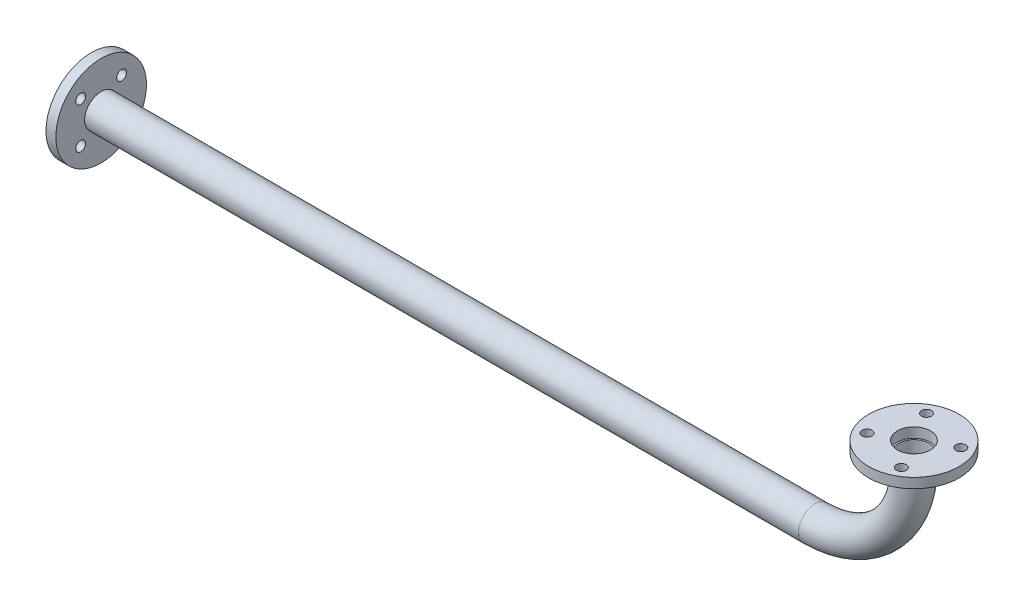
ISO-10303-21;
HEADER;
FILE_DESCRIPTION(('STEP AP214'),'2;1');
FILE_NAME('part.step','',(''),(''),'','','');
FILE_SCHEMA(('AUTOMOTIVE_DESIGN { 1 0 10303 214 1 1 1 1 }'));
ENDSEC;
DATA;
#1=APPLICATION_CONTEXT('core data for automotive mechanical design processes');
#2=APPLICATION_PROTOCOL_DEFINITION('international standard','automotive_design',2000,#1);
#3=PRODUCT_CONTEXT('',#1,'mechanical');
#4=PRODUCT('Part','Part','',(#3));
#5=PRODUCT_RELATED_PRODUCT_CATEGORY('part','',(#4));
#6=PRODUCT_DEFINITION_FORMATION('','',#4);
#7=PRODUCT_DEFINITION_CONTEXT('part definition',#1,'design');
#8=PRODUCT_DEFINITION('design','',#6,#7);
#9=PRODUCT_DEFINITION_SHAPE('','',#8);
#10=(LENGTH_UNIT() NAMED_UNIT(*) SI_UNIT(.MILLI.,.METRE.));
#11=(NAMED_UNIT(*) PLANE_ANGLE_UNIT() SI_UNIT($,.RADIAN.));
#12=(NAMED_UNIT(*) SI_UNIT($,.STERADIAN.) SOLID_ANGLE_UNIT());
#13=UNCERTAINTY_MEASURE_WITH_UNIT(LENGTH_MEASURE(1.E-05),#10,'distance_accuracy_value','');
#14=(GEOMETRIC_REPRESENTATION_CONTEXT(3) GLOBAL_UNCERTAINTY_ASSIGNED_CONTEXT((#13)) GLOBAL_UNIT_ASSIGNED_CONTEXT((#10,
#11,#12)) REPRESENTATION_CONTEXT('',''));
#15=CARTESIAN_POINT('',(0.,0.,0.));
#16=DIRECTION('',(0.,0.,1.));
#17=DIRECTION('',(1.,0.,0.));
#18=AXIS2_PLACEMENT_3D('',#15,#16,#17);
#19=CARTESIAN_POINT('',(0.,18.,0.));
#20=DIRECTION('',(0.,1.,0.));
#21=DIRECTION('',(0.,0.,1.));
#22=AXIS2_PLACEMENT_3D('',#19,#20,#21);
#23=PLANE('',#22);
#24=CARTESIAN_POINT('',(54.1265877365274,18.,-31.2500000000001));
#25=DIRECTION('',(0.,1.,0.));
#26=DIRECTION('',(0.,0.,-1.));
#27=AXIS2_PLACEMENT_3D('',#24,#25,#26);
#28=CIRCLE('',#27,9.00000000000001);
#29=CARTESIAN_POINT('',(54.1265877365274,18.,-40.2500000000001));
#30=VERTEX_POINT('',#29);
#31=EDGE_CURVE('E94',#30,#30,#28,.T.);
#32=ORIENTED_EDGE('',*,*,#31,.F.);
#33=EDGE_LOOP('',(#32));
#34=FACE_BOUND('',#33,.T.);
#35=CARTESIAN_POINT('',(-31.2500000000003,18.,-54.1265877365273));
#36=DIRECTION('',(0.,1.,0.));
#37=DIRECTION('',(0.,0.,1.));
#38=AXIS2_PLACEMENT_3D('',#35,#36,#37);
#39=CIRCLE('',#38,9.00000000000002);
#40=CARTESIAN_POINT('',(-31.2500000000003,18.,-45.1265877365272));
#41=VERTEX_POINT('',#40);
#42=EDGE_CURVE('E78',#41,#41,#39,.T.);
#43=ORIENTED_EDGE('',*,*,#42,.F.);
#44=EDGE_LOOP('',(#43));
#45=FACE_BOUND('',#44,.T.);
#46=CARTESIAN_POINT('',(0.,18.,0.));
#47=DIRECTION('',(0.,1.,0.));
#48=DIRECTION('',(0.,0.,1.));
#49=AXIS2_PLACEMENT_3D('',#46,#47,#48);
#50=CIRCLE('',#49,82.5);
#51=CARTESIAN_POINT('',(0.,18.,82.5));
#52=VERTEX_POINT('',#51);
#53=EDGE_CURVE('E12',#52,#52,#50,.T.);
#54=ORIENTED_EDGE('',*,*,#53,.T.);
#55=EDGE_LOOP('',(#54));
#56=FACE_BOUND('',#55,.T.);
#57=CARTESIAN_POINT('',(0.,18.,0.));
#58=DIRECTION('',(0.,1.,0.));
#59=DIRECTION('',(0.,0.,1.));
#60=AXIS2_PLACEMENT_3D('',#57,#58,#59);
#61=CIRCLE('',#60,30.15);
#62=CARTESIAN_POINT('',(0.,18.,30.15));
#63=VERTEX_POINT('',#62);
#64=EDGE_CURVE('E72',#63,#63,#61,.T.);
#65=ORIENTED_EDGE('',*,*,#64,.F.);
#66=EDGE_LOOP('',(#65));
#67=FACE_BOUND('',#66,.T.);
#68=CARTESIAN_POINT('',(-54.1265877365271,18.,31.2500000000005));
#69=DIRECTION('',(0.,1.,0.));
#70=DIRECTION('',(0.,0.,1.));
#71=AXIS2_PLACEMENT_3D('',#68,#69,#70);
#72=CIRCLE('',#71,9.);
#73=CARTESIAN_POINT('',(-54.1265877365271,18.,40.2500000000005));
#74=VERTEX_POINT('',#73);
#75=EDGE_CURVE('E86',#74,#74,#72,.T.);
#76=ORIENTED_EDGE('',*,*,#75,.F.);
#77=EDGE_LOOP('',(#76));
#78=FACE_BOUND('',#77,.T.);
#79=CARTESIAN_POINT('',(31.2500000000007,18.,54.126587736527));
#80=DIRECTION('',(0.,1.,0.));
#81=DIRECTION('',(0.,0.,-1.));
#82=AXIS2_PLACEMENT_3D('',#79,#80,#81);
#83=CIRCLE('',#82,9.00000000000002);
#84=CARTESIAN_POINT('',(31.2500000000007,18.,45.126587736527));
#85=VERTEX_POINT('',#84);
#86=EDGE_CURVE('E102',#85,#85,#83,.T.);
#87=ORIENTED_EDGE('',*,*,#86,.F.);
#88=EDGE_LOOP('',(#87));
#89=FACE_BOUND('',#88,.T.);
#90=ADVANCED_FACE('F58',(#34,#45,#56,#67,#78,#89),#23,.T.);
#91=CARTESIAN_POINT('',(0.,0.,0.));
#92=DIRECTION('',(0.,1.,0.));
#93=DIRECTION('',(0.,0.,1.));
#94=AXIS2_PLACEMENT_3D('',#91,#92,#93);
#95=PLANE('',#94);
#96=CARTESIAN_POINT('',(0.,0.,0.));
#97=DIRECTION('',(0.,1.,0.));
#98=DIRECTION('',(0.,0.,1.));
#99=AXIS2_PLACEMENT_3D('',#96,#97,#98);
#100=CIRCLE('',#99,82.5);
#101=CARTESIAN_POINT('',(0.,0.,82.5));
#102=VERTEX_POINT('',#101);
#103=EDGE_CURVE('E62',#102,#102,#100,.T.);
#104=ORIENTED_EDGE('',*,*,#103,.F.);
#105=EDGE_LOOP('',(#104));
#106=FACE_BOUND('',#105,.T.);
#107=CARTESIAN_POINT('',(0.,0.,0.));
#108=DIRECTION('',(0.,1.,0.));
#109=DIRECTION('',(0.,0.,1.));
#110=AXIS2_PLACEMENT_3D('',#107,#108,#109);
#111=CIRCLE('',#110,30.15);
#112=CARTESIAN_POINT('',(0.,0.,30.15));
#113=VERTEX_POINT('',#112);
#114=EDGE_CURVE('E74',#113,#113,#111,.T.);
#115=ORIENTED_EDGE('',*,*,#114,.T.);
#116=EDGE_LOOP('',(#115));
#117=FACE_BOUND('',#116,.T.);
#118=CARTESIAN_POINT('',(-31.2500000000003,0.,-54.1265877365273));
#119=DIRECTION('',(0.,1.,0.));
#120=DIRECTION('',(0.,0.,1.));
#121=AXIS2_PLACEMENT_3D('',#118,#119,#120);
#122=CIRCLE('',#121,9.00000000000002);
#123=CARTESIAN_POINT('',(-31.2500000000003,0.,-45.1265877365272));
#124=VERTEX_POINT('',#123);
#125=EDGE_CURVE('E82',#124,#124,#122,.T.);
#126=ORIENTED_EDGE('',*,*,#125,.T.);
#127=EDGE_LOOP('',(#126));
#128=FACE_BOUND('',#127,.T.);
#129=CARTESIAN_POINT('',(-54.1265877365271,0.,31.2500000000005));
#130=DIRECTION('',(0.,1.,0.));
#131=DIRECTION('',(0.,0.,1.));
#132=AXIS2_PLACEMENT_3D('',#129,#130,#131);
#133=CIRCLE('',#132,9.);
#134=CARTESIAN_POINT('',(-54.1265877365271,0.,40.2500000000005));
#135=VERTEX_POINT('',#134);
#136=EDGE_CURVE('E90',#135,#135,#133,.T.);
#137=ORIENTED_EDGE('',*,*,#136,.T.);
#138=EDGE_LOOP('',(#137));
#139=FACE_BOUND('',#138,.T.);
#140=CARTESIAN_POINT('',(54.1265877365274,0.,-31.2500000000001));
#141=DIRECTION('',(0.,1.,0.));
#142=DIRECTION('',(0.,0.,-1.));
#143=AXIS2_PLACEMENT_3D('',#140,#141,#142);
#144=CIRCLE('',#143,9.00000000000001);
#145=CARTESIAN_POINT('',(54.1265877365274,0.,-40.2500000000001));
#146=VERTEX_POINT('',#145);
#147=EDGE_CURVE('E98',#146,#146,#144,.T.);
#148=ORIENTED_EDGE('',*,*,#147,.T.);
#149=EDGE_LOOP('',(#148));
#150=FACE_BOUND('',#149,.T.);
#151=CARTESIAN_POINT('',(31.2500000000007,0.,54.126587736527));
#152=DIRECTION('',(0.,1.,0.));
#153=DIRECTION('',(0.,0.,-1.));
#154=AXIS2_PLACEMENT_3D('',#151,#152,#153);
#155=CIRCLE('',#154,9.00000000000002);
#156=CARTESIAN_POINT('',(31.2500000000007,0.,45.126587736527));
#157=VERTEX_POINT('',#156);
#158=EDGE_CURVE('E106',#157,#157,#155,.T.);
#159=ORIENTED_EDGE('',*,*,#158,.T.);
#160=EDGE_LOOP('',(#159));
#161=FACE_BOUND('',#160,.T.);
#162=ADVANCED_FACE('F119',(#106,#117,#128,#139,#150,#161),#95,.F.);
#163=CARTESIAN_POINT('',(0.,18.,0.));
#164=DIRECTION('',(0.,-1.,0.));
#165=DIRECTION('',(0.,0.,-1.));
#166=AXIS2_PLACEMENT_3D('',#163,#164,#165);
#167=CYLINDRICAL_SURFACE('',#166,82.5);
#168=ORIENTED_EDGE('',*,*,#53,.F.);
#169=EDGE_LOOP('',(#168));
#170=FACE_BOUND('',#169,.T.);
#171=ORIENTED_EDGE('',*,*,#103,.T.);
#172=EDGE_LOOP('',(#171));
#173=FACE_BOUND('',#172,.T.);
#174=ADVANCED_FACE('F60',(#170,#173),#167,.T.);
#175=CARTESIAN_POINT('',(0.,18.,0.));
#176=DIRECTION('',(0.,-1.,0.));
#177=DIRECTION('',(0.,0.,-1.));
#178=AXIS2_PLACEMENT_3D('',#175,#176,#177);
#179=CYLINDRICAL_SURFACE('',#178,30.15);
#180=ORIENTED_EDGE('',*,*,#64,.T.);
#181=EDGE_LOOP('',(#180));
#182=FACE_BOUND('',#181,.T.);
#183=ORIENTED_EDGE('',*,*,#114,.F.);
#184=EDGE_LOOP('',(#183));
#185=FACE_BOUND('',#184,.T.);
#186=ADVANCED_FACE('F129',(#182,#185),#179,.F.);
#187=CARTESIAN_POINT('',(-31.2500000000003,18.,-54.1265877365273));
#188=DIRECTION('',(0.,-1.,0.));
#189=DIRECTION('',(0.,0.,-1.));
#190=AXIS2_PLACEMENT_3D('',#187,#188,#189);
#191=CYLINDRICAL_SURFACE('',#190,9.00000000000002);
#192=ORIENTED_EDGE('',*,*,#42,.T.);
#193=EDGE_LOOP('',(#192));
#194=FACE_BOUND('',#193,.T.);
#195=ORIENTED_EDGE('',*,*,#125,.F.);
#196=EDGE_LOOP('',(#195));
#197=FACE_BOUND('',#196,.T.);
#198=ADVANCED_FACE('F132',(#194,#197),#191,.F.);
#199=CARTESIAN_POINT('',(-54.1265877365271,18.,31.2500000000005));
#200=DIRECTION('',(0.,-1.,0.));
#201=DIRECTION('',(0.,0.,-1.));
#202=AXIS2_PLACEMENT_3D('',#199,#200,#201);
#203=CYLINDRICAL_SURFACE('',#202,9.);
#204=ORIENTED_EDGE('',*,*,#75,.T.);
#205=EDGE_LOOP('',(#204));
#206=FACE_BOUND('',#205,.T.);
#207=ORIENTED_EDGE('',*,*,#136,.F.);
#208=EDGE_LOOP('',(#207));
#209=FACE_BOUND('',#208,.T.);
#210=ADVANCED_FACE('F136',(#206,#209),#203,.F.);
#211=CARTESIAN_POINT('',(54.1265877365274,18.,-31.2500000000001));
#212=DIRECTION('',(0.,-1.,0.));
#213=DIRECTION('',(0.,0.,-1.));
#214=AXIS2_PLACEMENT_3D('',#211,#212,#213);
#215=CYLINDRICAL_SURFACE('',#214,9.00000000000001);
#216=ORIENTED_EDGE('',*,*,#31,.T.);
#217=EDGE_LOOP('',(#216));
#218=FACE_BOUND('',#217,.T.);
#219=ORIENTED_EDGE('',*,*,#147,.F.);
#220=EDGE_LOOP('',(#219));
#221=FACE_BOUND('',#220,.T.);
#222=ADVANCED_FACE('F140',(#218,#221),#215,.F.);
#223=CARTESIAN_POINT('',(31.2500000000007,18.,54.126587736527));
#224=DIRECTION('',(0.,-1.,0.));
#225=DIRECTION('',(0.,0.,-1.));
#226=AXIS2_PLACEMENT_3D('',#223,#224,#225);
#227=CYLINDRICAL_SURFACE('',#226,9.00000000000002);
#228=ORIENTED_EDGE('',*,*,#86,.T.);
#229=EDGE_LOOP('',(#228));
#230=FACE_BOUND('',#229,.T.);
#231=ORIENTED_EDGE('',*,*,#158,.F.);
#232=EDGE_LOOP('',(#231));
#233=FACE_BOUND('',#232,.T.);
#234=ADVANCED_FACE('F115',(#230,#233),#227,.F.);
#235=CLOSED_SHELL('',(#90,#162,#174,#186,#198,#210,#222,#234));
#236=MANIFOLD_SOLID_BREP('B2',#235);
#237=CARTESIAN_POINT('',(-1498.,-202.,0.));
#238=DIRECTION('',(-1.,0.,0.));
#239=DIRECTION('',(0.,-1.,0.));
#240=AXIS2_PLACEMENT_3D('',#237,#238,#239);
#241=PLANE('',#240);
#242=CARTESIAN_POINT('',(-1498.,-239.283692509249,37.2836925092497));
#243=DIRECTION('',(-1.,0.,0.));
#244=DIRECTION('',(0.,-1.,0.));
#245=AXIS2_PLACEMENT_3D('',#242,#243,#244);
#246=CIRCLE('',#245,9.00000000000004);
#247=CARTESIAN_POINT('',(-1498.,-248.283692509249,37.2836925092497));
#248=VERTEX_POINT('',#247);
#249=EDGE_CURVE('E287',#248,#248,#246,.T.);
#250=ORIENTED_EDGE('',*,*,#249,.F.);
#251=EDGE_LOOP('',(#250));
#252=FACE_BOUND('',#251,.T.);
#253=CARTESIAN_POINT('',(-1498.,-164.716307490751,-37.2836925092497));
#254=DIRECTION('',(-1.,0.,0.));
#255=DIRECTION('',(0.,-1.,0.));
#256=AXIS2_PLACEMENT_3D('',#253,#254,#255);
#257=CIRCLE('',#256,9.00000000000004);
#258=CARTESIAN_POINT('',(-1498.,-173.716307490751,-37.2836925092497));
#259=VERTEX_POINT('',#258);
#260=EDGE_CURVE('E271',#259,#259,#257,.T.);
#261=ORIENTED_EDGE('',*,*,#260,.F.);
#262=EDGE_LOOP('',(#261));
#263=FACE_BOUND('',#262,.T.);
#264=CARTESIAN_POINT('',(-1498.,-202.,0.));
#265=DIRECTION('',(-1.,0.,0.));
#266=DIRECTION('',(0.,-1.,0.));
#267=AXIS2_PLACEMENT_3D('',#264,#265,#266);
#268=CIRCLE('',#267,82.5);
#269=CARTESIAN_POINT('',(-1498.,-284.5,0.));
#270=VERTEX_POINT('',#269);
#271=EDGE_CURVE('E57',#270,#270,#268,.T.);
#272=ORIENTED_EDGE('',*,*,#271,.T.);
#273=EDGE_LOOP('',(#272));
#274=FACE_BOUND('',#273,.T.);
#275=CARTESIAN_POINT('',(-1498.,-202.,0.));
#276=DIRECTION('',(-1.,0.,0.));
#277=DIRECTION('',(0.,-1.,0.));
#278=AXIS2_PLACEMENT_3D('',#275,#276,#277);
#279=CIRCLE('',#278,30.15);
#280=CARTESIAN_POINT('',(-1498.,-232.15,0.));
#281=VERTEX_POINT('',#280);
#282=EDGE_CURVE('E265',#281,#281,#279,.T.);
#283=ORIENTED_EDGE('',*,*,#282,.F.);
#284=EDGE_LOOP('',(#283));
#285=FACE_BOUND('',#284,.T.);
#286=CARTESIAN_POINT('',(-1498.,-164.716307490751,37.2836925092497));
#287=DIRECTION('',(-1.,0.,0.));
#288=DIRECTION('',(0.,1.,0.));
#289=AXIS2_PLACEMENT_3D('',#286,#287,#288);
#290=CIRCLE('',#289,9.00000000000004);
#291=CARTESIAN_POINT('',(-1498.,-155.716307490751,37.2836925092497));
#292=VERTEX_POINT('',#291);
#293=EDGE_CURVE('E279',#292,#292,#290,.T.);
#294=ORIENTED_EDGE('',*,*,#293,.F.);
#295=EDGE_LOOP('',(#294));
#296=FACE_BOUND('',#295,.T.);
#297=CARTESIAN_POINT('',(-1498.,-239.283692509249,-37.2836925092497));
#298=DIRECTION('',(-1.,0.,0.));
#299=DIRECTION('',(0.,1.,0.));
#300=AXIS2_PLACEMENT_3D('',#297,#298,#299);
#301=CIRCLE('',#300,9.00000000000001);
#302=CARTESIAN_POINT('',(-1498.,-230.283692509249,-37.2836925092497));
#303=VERTEX_POINT('',#302);
#304=EDGE_CURVE('E295',#303,#303,#301,.T.);
#305=ORIENTED_EDGE('',*,*,#304,.F.);
#306=EDGE_LOOP('',(#305));
#307=FACE_BOUND('',#306,.T.);
#308=ADVANCED_FACE('F251',(#252,#263,#274,#285,#296,#307),#241,.T.);
#309=CARTESIAN_POINT('',(-1480.,-202.,0.));
#310=DIRECTION('',(-1.,0.,0.));
#311=DIRECTION('',(0.,-1.,0.));
#312=AXIS2_PLACEMENT_3D('',#309,#310,#311);
#313=PLANE('',#312);
#314=CARTESIAN_POINT('',(-1480.,-202.,0.));
#315=DIRECTION('',(-1.,0.,0.));
#316=DIRECTION('',(0.,-1.,0.));
#317=AXIS2_PLACEMENT_3D('',#314,#315,#316);
#318=CIRCLE('',#317,82.5);
#319=CARTESIAN_POINT('',(-1480.,-284.5,0.));
#320=VERTEX_POINT('',#319);
#321=EDGE_CURVE('E255',#320,#320,#318,.T.);
#322=ORIENTED_EDGE('',*,*,#321,.F.);
#323=EDGE_LOOP('',(#322));
#324=FACE_BOUND('',#323,.T.);
#325=CARTESIAN_POINT('',(-1480.,-202.,0.));
#326=DIRECTION('',(-1.,0.,0.));
#327=DIRECTION('',(0.,-1.,0.));
#328=AXIS2_PLACEMENT_3D('',#325,#326,#327);
#329=CIRCLE('',#328,30.15);
#330=CARTESIAN_POINT('',(-1480.,-232.15,0.));
#331=VERTEX_POINT('',#330);
#332=EDGE_CURVE('E267',#331,#331,#329,.T.);
#333=ORIENTED_EDGE('',*,*,#332,.T.);
#334=EDGE_LOOP('',(#333));
#335=FACE_BOUND('',#334,.T.);
#336=CARTESIAN_POINT('',(-1480.,-164.716307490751,-37.2836925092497));
#337=DIRECTION('',(-1.,0.,0.));
#338=DIRECTION('',(0.,-1.,0.));
#339=AXIS2_PLACEMENT_3D('',#336,#337,#338);
#340=CIRCLE('',#339,9.00000000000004);
#341=CARTESIAN_POINT('',(-1480.,-173.716307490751,-37.2836925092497));
#342=VERTEX_POINT('',#341);
#343=EDGE_CURVE('E275',#342,#342,#340,.T.);
#344=ORIENTED_EDGE('',*,*,#343,.T.);
#345=EDGE_LOOP('',(#344));
#346=FACE_BOUND('',#345,.T.);
#347=CARTESIAN_POINT('',(-1480.,-164.716307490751,37.2836925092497));
#348=DIRECTION('',(-1.,0.,0.));
#349=DIRECTION('',(0.,1.,0.));
#350=AXIS2_PLACEMENT_3D('',#347,#348,#349);
#351=CIRCLE('',#350,9.00000000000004);
#352=CARTESIAN_POINT('',(-1480.,-155.716307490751,37.2836925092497));
#353=VERTEX_POINT('',#352);
#354=EDGE_CURVE('E283',#353,#353,#351,.T.);
#355=ORIENTED_EDGE('',*,*,#354,.T.);
#356=EDGE_LOOP('',(#355));
#357=FACE_BOUND('',#356,.T.);
#358=CARTESIAN_POINT('',(-1480.,-239.283692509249,37.2836925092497));
#359=DIRECTION('',(-1.,0.,0.));
#360=DIRECTION('',(0.,-1.,0.));
#361=AXIS2_PLACEMENT_3D('',#358,#359,#360);
#362=CIRCLE('',#361,9.00000000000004);
#363=CARTESIAN_POINT('',(-1480.,-248.283692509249,37.2836925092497));
#364=VERTEX_POINT('',#363);
#365=EDGE_CURVE('E291',#364,#364,#362,.T.);
#366=ORIENTED_EDGE('',*,*,#365,.T.);
#367=EDGE_LOOP('',(#366));
#368=FACE_BOUND('',#367,.T.);
#369=CARTESIAN_POINT('',(-1480.,-239.283692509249,-37.2836925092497));
#370=DIRECTION('',(-1.,0.,0.));
#371=DIRECTION('',(0.,1.,0.));
#372=AXIS2_PLACEMENT_3D('',#369,#370,#371);
#373=CIRCLE('',#372,9.00000000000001);
#374=CARTESIAN_POINT('',(-1480.,-230.283692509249,-37.2836925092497));
#375=VERTEX_POINT('',#374);
#376=EDGE_CURVE('E299',#375,#375,#373,.T.);
#377=ORIENTED_EDGE('',*,*,#376,.T.);
#378=EDGE_LOOP('',(#377));
#379=FACE_BOUND('',#378,.T.);
#380=ADVANCED_FACE('F312',(#324,#335,#346,#357,#368,#379),#313,.F.);
#381=CARTESIAN_POINT('',(-1498.,-202.,0.));
#382=DIRECTION('',(1.,0.,0.));
#383=DIRECTION('',(0.,1.,0.));
#384=AXIS2_PLACEMENT_3D('',#381,#382,#383);
#385=CYLINDRICAL_SURFACE('',#384,82.5);
#386=ORIENTED_EDGE('',*,*,#271,.F.);
#387=EDGE_LOOP('',(#386));
#388=FACE_BOUND('',#387,.T.);
#389=ORIENTED_EDGE('',*,*,#321,.T.);
#390=EDGE_LOOP('',(#389));
#391=FACE_BOUND('',#390,.T.);
#392=ADVANCED_FACE('F253',(#388,#391),#385,.T.);
#393=CARTESIAN_POINT('',(-1498.,-202.,0.));
#394=DIRECTION('',(1.,0.,0.));
#395=DIRECTION('',(0.,1.,0.));
#396=AXIS2_PLACEMENT_3D('',#393,#394,#395);
#397=CYLINDRICAL_SURFACE('',#396,30.15);
#398=ORIENTED_EDGE('',*,*,#282,.T.);
#399=EDGE_LOOP('',(#398));
#400=FACE_BOUND('',#399,.T.);
#401=ORIENTED_EDGE('',*,*,#332,.F.);
#402=EDGE_LOOP('',(#401));
#403=FACE_BOUND('',#402,.T.);
#404=ADVANCED_FACE('F322',(#400,#403),#397,.F.);
#405=CARTESIAN_POINT('',(-1498.,-164.716307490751,-37.2836925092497));
#406=DIRECTION('',(1.,0.,0.));
#407=DIRECTION('',(0.,1.,0.));
#408=AXIS2_PLACEMENT_3D('',#405,#406,#407);
#409=CYLINDRICAL_SURFACE('',#408,9.00000000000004);
#410=ORIENTED_EDGE('',*,*,#260,.T.);
#411=EDGE_LOOP('',(#410));
#412=FACE_BOUND('',#411,.T.);
#413=ORIENTED_EDGE('',*,*,#343,.F.);
#414=EDGE_LOOP('',(#413));
#415=FACE_BOUND('',#414,.T.);
#416=ADVANCED_FACE('F325',(#412,#415),#409,.F.);
#417=CARTESIAN_POINT('',(-1498.,-164.716307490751,37.2836925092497));
#418=DIRECTION('',(1.,0.,0.));
#419=DIRECTION('',(0.,1.,0.));
#420=AXIS2_PLACEMENT_3D('',#417,#418,#419);
#421=CYLINDRICAL_SURFACE('',#420,9.00000000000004);
#422=ORIENTED_EDGE('',*,*,#293,.T.);
#423=EDGE_LOOP('',(#422));
#424=FACE_BOUND('',#423,.T.);
#425=ORIENTED_EDGE('',*,*,#354,.F.);
#426=EDGE_LOOP('',(#425));
#427=FACE_BOUND('',#426,.T.);
#428=ADVANCED_FACE('F329',(#424,#427),#421,.F.);
#429=CARTESIAN_POINT('',(-1498.,-239.283692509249,37.2836925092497));
#430=DIRECTION('',(1.,0.,0.));
#431=DIRECTION('',(0.,1.,0.));
#432=AXIS2_PLACEMENT_3D('',#429,#430,#431);
#433=CYLINDRICAL_SURFACE('',#432,9.00000000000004);
#434=ORIENTED_EDGE('',*,*,#249,.T.);
#435=EDGE_LOOP('',(#434));
#436=FACE_BOUND('',#435,.T.);
#437=ORIENTED_EDGE('',*,*,#365,.F.);
#438=EDGE_LOOP('',(#437));
#439=FACE_BOUND('',#438,.T.);
#440=ADVANCED_FACE('F333',(#436,#439),#433,.F.);
#441=CARTESIAN_POINT('',(-1498.,-239.283692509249,-37.2836925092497));
#442=DIRECTION('',(1.,0.,0.));
#443=DIRECTION('',(0.,1.,0.));
#444=AXIS2_PLACEMENT_3D('',#441,#442,#443);
#445=CYLINDRICAL_SURFACE('',#444,9.00000000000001);
#446=ORIENTED_EDGE('',*,*,#304,.T.);
#447=EDGE_LOOP('',(#446));
#448=FACE_BOUND('',#447,.T.);
#449=ORIENTED_EDGE('',*,*,#376,.F.);
#450=EDGE_LOOP('',(#449));
#451=FACE_BOUND('',#450,.T.);
#452=ADVANCED_FACE('F308',(#448,#451),#445,.F.);
#453=CLOSED_SHELL('',(#308,#380,#392,#404,#416,#428,#440,#452));
#454=MANIFOLD_SOLID_BREP('B7',#453);
#455=CARTESIAN_POINT('',(0.,-22.,0.));
#456=DIRECTION('',(0.,1.,0.));
#457=DIRECTION('',(0.,0.,1.));
#458=AXIS2_PLACEMENT_3D('',#455,#456,#457);
#459=CYLINDRICAL_SURFACE('',#458,27.25);
#460=CARTESIAN_POINT('',(0.,0.,0.));
#461=DIRECTION('',(0.,-1.,0.));
#462=DIRECTION('',(0.,0.,-1.));
#463=AXIS2_PLACEMENT_3D('',#460,#461,#462);
#464=CIRCLE('',#463,27.25);
#465=CARTESIAN_POINT('',(0.,0.,27.25));
#466=VERTEX_POINT('',#465);
#467=EDGE_CURVE('E453',#466,#466,#464,.T.);
#468=CARTESIAN_POINT('',(0.,-22.,0.));
#469=DIRECTION('',(0.,-1.,0.));
#470=DIRECTION('',(0.,0.,-1.));
#471=AXIS2_PLACEMENT_3D('',#468,#469,#470);
#472=CIRCLE('',#471,27.25);
#473=CARTESIAN_POINT('',(0.,-22.,27.25));
#474=VERTEX_POINT('',#473);
#475=EDGE_CURVE('E448',#474,#474,#472,.T.);
#476=CARTESIAN_POINT('',(0.,0.,27.25));
#477=CARTESIAN_POINT('',(0.,-0.229166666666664,27.25));
#478=CARTESIAN_POINT('',(0.,-0.45833333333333,27.25));
#479=CARTESIAN_POINT('',(0.,-0.916666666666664,27.25));
#480=CARTESIAN_POINT('',(0.,-1.14583333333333,27.25));
#481=CARTESIAN_POINT('',(0.,-1.60416666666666,27.25));
#482=CARTESIAN_POINT('',(0.,-1.83333333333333,27.25));
#483=CARTESIAN_POINT('',(0.,-2.29166666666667,27.25));
#484=CARTESIAN_POINT('',(0.,-2.52083333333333,27.25));
#485=CARTESIAN_POINT('',(0.,-2.97916666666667,27.25));
#486=CARTESIAN_POINT('',(0.,-3.20833333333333,27.25));
#487=CARTESIAN_POINT('',(0.,-3.66666666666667,27.25));
#488=CARTESIAN_POINT('',(0.,-3.89583333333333,27.25));
#489=CARTESIAN_POINT('',(0.,-4.35416666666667,27.25));
#490=CARTESIAN_POINT('',(0.,-4.58333333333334,27.25));
#491=CARTESIAN_POINT('',(0.,-5.04166666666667,27.25));
#492=CARTESIAN_POINT('',(0.,-5.27083333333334,27.25));
#493=CARTESIAN_POINT('',(0.,-5.72916666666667,27.25));
#494=CARTESIAN_POINT('',(0.,-5.95833333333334,27.25));
#495=CARTESIAN_POINT('',(0.,-6.41666666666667,27.25));
#496=CARTESIAN_POINT('',(0.,-6.64583333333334,27.25));
#497=CARTESIAN_POINT('',(0.,-7.10416666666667,27.25));
#498=CARTESIAN_POINT('',(0.,-7.33333333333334,27.25));
#499=CARTESIAN_POINT('',(0.,-7.79166666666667,27.25));
#500=CARTESIAN_POINT('',(0.,-8.02083333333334,27.25));
#501=CARTESIAN_POINT('',(0.,-8.47916666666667,27.25));
#502=CARTESIAN_POINT('',(0.,-8.70833333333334,27.25));
#503=CARTESIAN_POINT('',(0.,-9.16666666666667,27.25));
#504=CARTESIAN_POINT('',(0.,-9.39583333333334,27.25));
#505=CARTESIAN_POINT('',(0.,-9.85416666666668,27.25));
#506=CARTESIAN_POINT('',(0.,-10.0833333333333,27.25));
#507=CARTESIAN_POINT('',(0.,-10.5416666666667,27.25));
#508=CARTESIAN_POINT('',(0.,-10.7708333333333,27.25));
#509=CARTESIAN_POINT('',(0.,-11.2291666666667,27.25));
#510=CARTESIAN_POINT('',(0.,-11.4583333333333,27.25));
#511=CARTESIAN_POINT('',(0.,-11.9166666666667,27.25));
#512=CARTESIAN_POINT('',(0.,-12.1458333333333,27.25));
#513=CARTESIAN_POINT('',(0.,-12.6041666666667,27.25));
#514=CARTESIAN_POINT('',(0.,-12.8333333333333,27.25));
#515=CARTESIAN_POINT('',(0.,-13.2916666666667,27.25));
#516=CARTESIAN_POINT('',(0.,-13.5208333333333,27.25));
#517=CARTESIAN_POINT('',(0.,-13.9791666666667,27.25));
#518=CARTESIAN_POINT('',(0.,-14.2083333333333,27.25));
#519=CARTESIAN_POINT('',(0.,-14.6666666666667,27.25));
#520=CARTESIAN_POINT('',(0.,-14.8958333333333,27.25));
#521=CARTESIAN_POINT('',(0.,-15.3541666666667,27.25));
#522=CARTESIAN_POINT('',(0.,-15.5833333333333,27.25));
#523=CARTESIAN_POINT('',(0.,-16.0416666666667,27.25));
#524=CARTESIAN_POINT('',(0.,-16.2708333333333,27.25));
#525=CARTESIAN_POINT('',(0.,-16.7291666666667,27.25));
#526=CARTESIAN_POINT('',(0.,-16.9583333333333,27.25));
#527=CARTESIAN_POINT('',(0.,-17.4166666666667,27.25));
#528=CARTESIAN_POINT('',(0.,-17.6458333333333,27.25));
#529=CARTESIAN_POINT('',(0.,-18.1041666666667,27.25));
#530=CARTESIAN_POINT('',(0.,-18.3333333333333,27.25));
#531=CARTESIAN_POINT('',(0.,-18.7916666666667,27.25));
#532=CARTESIAN_POINT('',(0.,-19.0208333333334,27.25));
#533=CARTESIAN_POINT('',(0.,-19.4791666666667,27.25));
#534=CARTESIAN_POINT('',(0.,-19.7083333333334,27.25));
#535=CARTESIAN_POINT('',(0.,-20.1666666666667,27.25));
#536=CARTESIAN_POINT('',(0.,-20.3958333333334,27.25));
#537=CARTESIAN_POINT('',(0.,-20.8541666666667,27.25));
#538=CARTESIAN_POINT('',(0.,-21.0833333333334,27.25));
#539=CARTESIAN_POINT('',(0.,-21.5416666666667,27.25));
#540=CARTESIAN_POINT('',(0.,-21.7708333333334,27.25));
#541=CARTESIAN_POINT('',(0.,-22.,27.25));
#542=B_SPLINE_CURVE_WITH_KNOTS('',3,(#476,#477,#478,#479,#480,#481,#482,#483,#484,#485,#486,
#487,#488,#489,#490,#491,#492,#493,#494,#495,#496,#497,#498,#499,#500,#501,#502,#503,#504,#505,
#506,#507,#508,#509,#510,#511,#512,#513,#514,#515,#516,#517,#518,#519,#520,#521,#522,#523,#524,
#525,#526,#527,#528,#529,#530,#531,#532,#533,#534,#535,#536,#537,#538,#539,#540,#541),
.UNSPECIFIED.,.F.,.F.,(4,2,2,2,2,2,2,2,2,2,2,2,2,2,2,2,2,2,2,2,2,2,2,2,2,2,2,2,2,2,2,2,4),(0.,
0.687500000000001,1.375,2.0625,2.75,3.4375,4.125,4.81250000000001,5.50000000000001,
6.18750000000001,6.87500000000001,7.56250000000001,8.25000000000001,8.93750000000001,
9.62500000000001,10.3125,11.,11.6875,12.375,13.0625,13.75,14.4375,15.125,15.8125,16.5,17.1875,
17.875,18.5625,19.25,19.9375,20.625,21.3125,22.),.UNSPECIFIED.);
#543=EDGE_CURVE('BSEAM444',#466,#474,#542,.T.);
#544=ORIENTED_EDGE('',*,*,#467,.F.);
#545=ORIENTED_EDGE('',*,*,#475,.T.);
#546=ORIENTED_EDGE('',*,*,#543,.T.);
#547=ORIENTED_EDGE('',*,*,#543,.F.);
#548=EDGE_LOOP('',(#544,#546,#545,#547));
#549=FACE_BOUND('',#548,.T.);
#550=ADVANCED_FACE('F444',(#549),#459,.F.);
#551=CARTESIAN_POINT('',(0.,-22.,0.));
#552=DIRECTION('',(0.,1.,0.));
#553=DIRECTION('',(0.,0.,1.));
#554=AXIS2_PLACEMENT_3D('',#551,#552,#553);
#555=CYLINDRICAL_SURFACE('',#554,30.15);
#556=CARTESIAN_POINT('',(0.,0.,0.));
#557=DIRECTION('',(0.,-1.,0.));
#558=DIRECTION('',(0.,0.,-1.));
#559=AXIS2_PLACEMENT_3D('',#556,#557,#558);
#560=CIRCLE('',#559,30.15);
#561=CARTESIAN_POINT('',(0.,0.,30.15));
#562=VERTEX_POINT('',#561);
#563=EDGE_CURVE('E459',#562,#562,#560,.T.);
#564=CARTESIAN_POINT('',(0.,-22.,0.));
#565=DIRECTION('',(0.,-1.,0.));
#566=DIRECTION('',(0.,0.,-1.));
#567=AXIS2_PLACEMENT_3D('',#564,#565,#566);
#568=CIRCLE('',#567,30.15);
#569=CARTESIAN_POINT('',(0.,-22.,30.15));
#570=VERTEX_POINT('',#569);
#571=EDGE_CURVE('E250',#570,#570,#568,.T.);
#572=CARTESIAN_POINT('',(0.,0.,30.15));
#573=CARTESIAN_POINT('',(0.,-0.229166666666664,30.15));
#574=CARTESIAN_POINT('',(0.,-0.45833333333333,30.15));
#575=CARTESIAN_POINT('',(0.,-0.916666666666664,30.15));
#576=CARTESIAN_POINT('',(0.,-1.14583333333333,30.15));
#577=CARTESIAN_POINT('',(0.,-1.60416666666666,30.15));
#578=CARTESIAN_POINT('',(0.,-1.83333333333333,30.15));
#579=CARTESIAN_POINT('',(0.,-2.29166666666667,30.15));
#580=CARTESIAN_POINT('',(0.,-2.52083333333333,30.15));
#581=CARTESIAN_POINT('',(0.,-2.97916666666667,30.15));
#582=CARTESIAN_POINT('',(0.,-3.20833333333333,30.15));
#583=CARTESIAN_POINT('',(0.,-3.66666666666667,30.15));
#584=CARTESIAN_POINT('',(0.,-3.89583333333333,30.15));
#585=CARTESIAN_POINT('',(0.,-4.35416666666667,30.15));
#586=CARTESIAN_POINT('',(0.,-4.58333333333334,30.15));
#587=CARTESIAN_POINT('',(0.,-5.04166666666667,30.15));
#588=CARTESIAN_POINT('',(0.,-5.27083333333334,30.15));
#589=CARTESIAN_POINT('',(0.,-5.72916666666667,30.15));
#590=CARTESIAN_POINT('',(0.,-5.95833333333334,30.15));
#591=CARTESIAN_POINT('',(0.,-6.41666666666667,30.15));
#592=CARTESIAN_POINT('',(0.,-6.64583333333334,30.15));
#593=CARTESIAN_POINT('',(0.,-7.10416666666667,30.15));
#594=CARTESIAN_POINT('',(0.,-7.33333333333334,30.15));
#595=CARTESIAN_POINT('',(0.,-7.79166666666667,30.15));
#596=CARTESIAN_POINT('',(0.,-8.02083333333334,30.15));
#597=CARTESIAN_POINT('',(0.,-8.47916666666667,30.15));
#598=CARTESIAN_POINT('',(0.,-8.70833333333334,30.15));
#599=CARTESIAN_POINT('',(0.,-9.16666666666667,30.15));
#600=CARTESIAN_POINT('',(0.,-9.39583333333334,30.15));
#601=CARTESIAN_POINT('',(0.,-9.85416666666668,30.15));
#602=CARTESIAN_POINT('',(0.,-10.0833333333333,30.15));
#603=CARTESIAN_POINT('',(0.,-10.5416666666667,30.15));
#604=CARTESIAN_POINT('',(0.,-10.7708333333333,30.15));
#605=CARTESIAN_POINT('',(0.,-11.2291666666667,30.15));
#606=CARTESIAN_POINT('',(0.,-11.4583333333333,30.15));
#607=CARTESIAN_POINT('',(0.,-11.9166666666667,30.15));
#608=CARTESIAN_POINT('',(0.,-12.1458333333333,30.15));
#609=CARTESIAN_POINT('',(0.,-12.6041666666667,30.15));
#610=CARTESIAN_POINT('',(0.,-12.8333333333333,30.15));
#611=CARTESIAN_POINT('',(0.,-13.2916666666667,30.15));
#612=CARTESIAN_POINT('',(0.,-13.5208333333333,30.15));
#613=CARTESIAN_POINT('',(0.,-13.9791666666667,30.15));
#614=CARTESIAN_POINT('',(0.,-14.2083333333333,30.15));
#615=CARTESIAN_POINT('',(0.,-14.6666666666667,30.15));
#616=CARTESIAN_POINT('',(0.,-14.8958333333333,30.15));
#617=CARTESIAN_POINT('',(0.,-15.3541666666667,30.15));
#618=CARTESIAN_POINT('',(0.,-15.5833333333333,30.15));
#619=CARTESIAN_POINT('',(0.,-16.0416666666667,30.15));
#620=CARTESIAN_POINT('',(0.,-16.2708333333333,30.15));
#621=CARTESIAN_POINT('',(0.,-16.7291666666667,30.15));
#622=CARTESIAN_POINT('',(0.,-16.9583333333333,30.15));
#623=CARTESIAN_POINT('',(0.,-17.4166666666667,30.15));
#624=CARTESIAN_POINT('',(0.,-17.6458333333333,30.15));
#625=CARTESIAN_POINT('',(0.,-18.1041666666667,30.15));
#626=CARTESIAN_POINT('',(0.,-18.3333333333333,30.15));
#627=CARTESIAN_POINT('',(0.,-18.7916666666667,30.15));
#628=CARTESIAN_POINT('',(0.,-19.0208333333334,30.15));
#629=CARTESIAN_POINT('',(0.,-19.4791666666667,30.15));
#630=CARTESIAN_POINT('',(0.,-19.7083333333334,30.15));
#631=CARTESIAN_POINT('',(0.,-20.1666666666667,30.15));
#632=CARTESIAN_POINT('',(0.,-20.3958333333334,30.15));
#633=CARTESIAN_POINT('',(0.,-20.8541666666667,30.15));
#634=CARTESIAN_POINT('',(0.,-21.0833333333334,30.15));
#635=CARTESIAN_POINT('',(0.,-21.5416666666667,30.15));
#636=CARTESIAN_POINT('',(0.,-21.7708333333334,30.15));
#637=CARTESIAN_POINT('',(0.,-22.,30.15));
#638=B_SPLINE_CURVE_WITH_KNOTS('',3,(#572,#573,#574,#575,#576,#577,#578,#579,#580,#581,#582,
#583,#584,#585,#586,#587,#588,#589,#590,#591,#592,#593,#594,#595,#596,#597,#598,#599,#600,#601,
#602,#603,#604,#605,#606,#607,#608,#609,#610,#611,#612,#613,#614,#615,#616,#617,#618,#619,#620,
#621,#622,#623,#624,#625,#626,#627,#628,#629,#630,#631,#632,#633,#634,#635,#636,#637),
.UNSPECIFIED.,.F.,.F.,(4,2,2,2,2,2,2,2,2,2,2,2,2,2,2,2,2,2,2,2,2,2,2,2,2,2,2,2,2,2,2,2,4),(0.,
0.687500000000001,1.375,2.0625,2.75,3.4375,4.125,4.81250000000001,5.50000000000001,
6.18750000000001,6.87500000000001,7.56250000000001,8.25000000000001,8.93750000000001,
9.62500000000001,10.3125,11.,11.6875,12.375,13.0625,13.75,14.4375,15.125,15.8125,16.5,17.1875,
17.875,18.5625,19.25,19.9375,20.625,21.3125,22.),.UNSPECIFIED.);
#639=EDGE_CURVE('BSEAM478',#562,#570,#638,.T.);
#640=ORIENTED_EDGE('',*,*,#563,.T.);
#641=ORIENTED_EDGE('',*,*,#571,.F.);
#642=ORIENTED_EDGE('',*,*,#639,.T.);
#643=ORIENTED_EDGE('',*,*,#639,.F.);
#644=EDGE_LOOP('',(#640,#642,#641,#643));
#645=FACE_BOUND('',#644,.T.);
#646=ADVANCED_FACE('F478',(#645),#555,.T.);
#647=CARTESIAN_POINT('',(0.,0.,0.));
#648=DIRECTION('',(0.,-1.,0.));
#649=DIRECTION('',(0.,0.,-1.));
#650=AXIS2_PLACEMENT_3D('',#647,#648,#649);
#651=PLANE('',#650);
#652=ORIENTED_EDGE('',*,*,#467,.T.);
#653=EDGE_LOOP('',(#652));
#654=FACE_BOUND('',#653,.T.);
#655=ORIENTED_EDGE('',*,*,#563,.F.);
#656=EDGE_LOOP('',(#655));
#657=FACE_BOUND('',#656,.T.);
#658=ADVANCED_FACE('F474',(#654,#657),#651,.F.);
#659=CARTESIAN_POINT('',(0.,-22.,0.));
#660=DIRECTION('',(0.,-1.,0.));
#661=DIRECTION('',(0.,0.,-1.));
#662=AXIS2_PLACEMENT_3D('',#659,#660,#661);
#663=PLANE('',#662);
#664=ORIENTED_EDGE('',*,*,#475,.F.);
#665=EDGE_LOOP('',(#664));
#666=FACE_BOUND('',#665,.T.);
#667=ORIENTED_EDGE('',*,*,#571,.T.);
#668=EDGE_LOOP('',(#667));
#669=FACE_BOUND('',#668,.T.);
#670=ADVANCED_FACE('F446',(#666,#669),#663,.T.);
#671=CLOSED_SHELL('',(#550,#646,#658,#670));
#672=MANIFOLD_SOLID_BREP('B52',#671);
#673=CARTESIAN_POINT('',(-180.,-22.,0.));
#674=DIRECTION('',(0.,0.,-1.));
#675=DIRECTION('',(-1.,0.,0.));
#676=AXIS2_PLACEMENT_3D('',#673,#674,#675);
#677=TOROIDAL_SURFACE('',#676,180.,27.25);
#678=CARTESIAN_POINT('',(0.,-22.,0.));
#679=DIRECTION('',(0.,1.,0.));
#680=DIRECTION('',(0.,0.,1.));
#681=AXIS2_PLACEMENT_3D('',#678,#679,#680);
#682=CIRCLE('',#681,27.25);
#683=CARTESIAN_POINT('',(27.25,-22.,0.));
#684=VERTEX_POINT('',#683);
#685=EDGE_CURVE('E562',#684,#684,#682,.T.);
#686=CARTESIAN_POINT('',(-180.,-202.,0.));
#687=DIRECTION('',(-1.,0.,0.));
#688=DIRECTION('',(0.,-1.,0.));
#689=AXIS2_PLACEMENT_3D('',#686,#687,#688);
#690=CIRCLE('',#689,27.25);
#691=CARTESIAN_POINT('',(-180.,-229.25,0.));
#692=VERTEX_POINT('',#691);
#693=EDGE_CURVE('E443',#692,#692,#690,.T.);
#694=CARTESIAN_POINT('',(-180.,-22.,0.));
#695=DIRECTION('',(0.,0.,-1.));
#696=DIRECTION('',(-1.,0.,0.));
#697=AXIS2_PLACEMENT_3D('',#694,#695,#696);
#698=CIRCLE('',#697,207.25);
#699=EDGE_CURVE('',#684,#692,#698,.T.);
#700=ORIENTED_EDGE('',*,*,#685,.T.);
#701=ORIENTED_EDGE('',*,*,#693,.T.);
#702=ORIENTED_EDGE('',*,*,#699,.T.);
#703=ORIENTED_EDGE('',*,*,#699,.F.);
#704=EDGE_LOOP('',(#700,#702,#701,#703));
#705=FACE_BOUND('',#704,.T.);
#706=ADVANCED_FACE('F549',(#705),#677,.F.);
#707=CARTESIAN_POINT('',(-180.,-202.,0.));
#708=DIRECTION('',(-1.,0.,0.));
#709=DIRECTION('',(0.,-1.,0.));
#710=AXIS2_PLACEMENT_3D('',#707,#708,#709);
#711=PLANE('',#710);
#712=ORIENTED_EDGE('',*,*,#693,.F.);
#713=EDGE_LOOP('',(#712));
#714=FACE_BOUND('',#713,.T.);
#715=CARTESIAN_POINT('',(-180.,-202.,0.));
#716=DIRECTION('',(-1.,0.,0.));
#717=DIRECTION('',(0.,-1.,0.));
#718=AXIS2_PLACEMENT_3D('',#715,#716,#717);
#719=CIRCLE('',#718,30.15);
#720=CARTESIAN_POINT('',(-180.,-232.15,0.));
#721=VERTEX_POINT('',#720);
#722=EDGE_CURVE('E556',#721,#721,#719,.F.);
#723=ORIENTED_EDGE('',*,*,#722,.F.);
#724=EDGE_LOOP('',(#723));
#725=FACE_BOUND('',#724,.T.);
#726=ADVANCED_FACE('F585',(#714,#725),#711,.T.);
#727=CARTESIAN_POINT('',(-180.,-22.,0.));
#728=DIRECTION('',(0.,0.,-1.));
#729=DIRECTION('',(-1.,0.,0.));
#730=AXIS2_PLACEMENT_3D('',#727,#728,#729);
#731=TOROIDAL_SURFACE('',#730,180.,30.15);
#732=CARTESIAN_POINT('',(0.,-22.,0.));
#733=DIRECTION('',(0.,1.,0.));
#734=DIRECTION('',(0.,0.,1.));
#735=AXIS2_PLACEMENT_3D('',#732,#733,#734);
#736=CIRCLE('',#735,30.15);
#737=CARTESIAN_POINT('',(30.15,-22.,0.));
#738=VERTEX_POINT('',#737);
#739=EDGE_CURVE('E568',#738,#738,#736,.F.);
#740=CARTESIAN_POINT('',(-180.,-22.,0.));
#741=DIRECTION('',(0.,0.,-1.));
#742=DIRECTION('',(-1.,0.,0.));
#743=AXIS2_PLACEMENT_3D('',#740,#741,#742);
#744=CIRCLE('',#743,210.15);
#745=EDGE_CURVE('',#738,#721,#744,.T.);
#746=ORIENTED_EDGE('',*,*,#739,.T.);
#747=ORIENTED_EDGE('',*,*,#722,.T.);
#748=ORIENTED_EDGE('',*,*,#745,.T.);
#749=ORIENTED_EDGE('',*,*,#745,.F.);
#750=EDGE_LOOP('',(#746,#748,#747,#749));
#751=FACE_BOUND('',#750,.T.);
#752=ADVANCED_FACE('F576',(#751),#731,.T.);
#753=CARTESIAN_POINT('',(0.,-22.,0.));
#754=DIRECTION('',(0.,1.,0.));
#755=DIRECTION('',(0.,0.,1.));
#756=AXIS2_PLACEMENT_3D('',#753,#754,#755);
#757=PLANE('',#756);
#758=ORIENTED_EDGE('',*,*,#685,.F.);
#759=EDGE_LOOP('',(#758));
#760=FACE_BOUND('',#759,.T.);
#761=ORIENTED_EDGE('',*,*,#739,.F.);
#762=EDGE_LOOP('',(#761));
#763=FACE_BOUND('',#762,.T.);
#764=ADVANCED_FACE('F578',(#760,#763),#757,.T.);
#765=CLOSED_SHELL('',(#706,#726,#752,#764));
#766=MANIFOLD_SOLID_BREP('B245',#765);
#767=CARTESIAN_POINT('',(-1480.,-202.,0.));
#768=DIRECTION('',(1.,0.,0.));
#769=DIRECTION('',(0.,1.,0.));
#770=AXIS2_PLACEMENT_3D('',#767,#768,#769);
#771=CYLINDRICAL_SURFACE('',#770,27.25);
#772=CARTESIAN_POINT('',(-1480.,-202.,0.));
#773=DIRECTION('',(-1.,0.,0.));
#774=DIRECTION('',(0.,0.,-1.));
#775=AXIS2_PLACEMENT_3D('',#772,#773,#774);
#776=CIRCLE('',#775,27.25);
#777=CARTESIAN_POINT('',(-1480.,-202.,-27.25));
#778=VERTEX_POINT('',#777);
#779=EDGE_CURVE('E666',#778,#778,#776,.T.);
#780=ORIENTED_EDGE('',*,*,#779,.T.);
#781=EDGE_LOOP('',(#780));
#782=FACE_BOUND('',#781,.T.);
#783=CARTESIAN_POINT('',(-180.,-202.,0.));
#784=DIRECTION('',(1.,0.,0.));
#785=DIRECTION('',(0.,1.,0.));
#786=AXIS2_PLACEMENT_3D('',#783,#784,#785);
#787=CIRCLE('',#786,27.25);
#788=CARTESIAN_POINT('',(-180.,-174.75,0.));
#789=VERTEX_POINT('',#788);
#790=EDGE_CURVE('E653',#789,#789,#787,.T.);
#791=ORIENTED_EDGE('',*,*,#790,.T.);
#792=EDGE_LOOP('',(#791));
#793=FACE_BOUND('',#792,.T.);
#794=ADVANCED_FACE('F649',(#782,#793),#771,.F.);
#795=CARTESIAN_POINT('',(-1480.,-202.,0.));
#796=DIRECTION('',(1.,0.,0.));
#797=DIRECTION('',(0.,1.,0.));
#798=AXIS2_PLACEMENT_3D('',#795,#796,#797);
#799=CYLINDRICAL_SURFACE('',#798,30.15);
#800=CARTESIAN_POINT('',(-1480.,-202.,0.));
#801=DIRECTION('',(-1.,0.,0.));
#802=DIRECTION('',(0.,0.,-1.));
#803=AXIS2_PLACEMENT_3D('',#800,#801,#802);
#804=CIRCLE('',#803,30.15);
#805=CARTESIAN_POINT('',(-1480.,-202.,-30.15));
#806=VERTEX_POINT('',#805);
#807=EDGE_CURVE('E658',#806,#806,#804,.T.);
#808=ORIENTED_EDGE('',*,*,#807,.F.);
#809=EDGE_LOOP('',(#808));
#810=FACE_BOUND('',#809,.T.);
#811=CARTESIAN_POINT('',(-180.,-202.,0.));
#812=DIRECTION('',(1.,0.,0.));
#813=DIRECTION('',(0.,1.,0.));
#814=AXIS2_PLACEMENT_3D('',#811,#812,#813);
#815=CIRCLE('',#814,30.15);
#816=CARTESIAN_POINT('',(-180.,-171.85,0.));
#817=VERTEX_POINT('',#816);
#818=EDGE_CURVE('E548',#817,#817,#815,.T.);
#819=ORIENTED_EDGE('',*,*,#818,.F.);
#820=EDGE_LOOP('',(#819));
#821=FACE_BOUND('',#820,.T.);
#822=ADVANCED_FACE('F683',(#810,#821),#799,.T.);
#823=CARTESIAN_POINT('',(-1480.,-202.,0.));
#824=DIRECTION('',(-1.,0.,0.));
#825=DIRECTION('',(0.,0.,-1.));
#826=AXIS2_PLACEMENT_3D('',#823,#824,#825);
#827=PLANE('',#826);
#828=ORIENTED_EDGE('',*,*,#779,.F.);
#829=EDGE_LOOP('',(#828));
#830=FACE_BOUND('',#829,.T.);
#831=ORIENTED_EDGE('',*,*,#807,.T.);
#832=EDGE_LOOP('',(#831));
#833=FACE_BOUND('',#832,.T.);
#834=ADVANCED_FACE('F679',(#830,#833),#827,.T.);
#835=CARTESIAN_POINT('',(-180.,-202.,0.));
#836=DIRECTION('',(1.,0.,0.));
#837=DIRECTION('',(0.,1.,0.));
#838=AXIS2_PLACEMENT_3D('',#835,#836,#837);
#839=PLANE('',#838);
#840=ORIENTED_EDGE('',*,*,#790,.F.);
#841=EDGE_LOOP('',(#840));
#842=FACE_BOUND('',#841,.T.);
#843=ORIENTED_EDGE('',*,*,#818,.T.);
#844=EDGE_LOOP('',(#843));
#845=FACE_BOUND('',#844,.T.);
#846=ADVANCED_FACE('F651',(#842,#845),#839,.T.);
#847=CLOSED_SHELL('',(#794,#822,#834,#846));
#848=MANIFOLD_SOLID_BREP('B438',#847);
#849=ADVANCED_BREP_SHAPE_REPRESENTATION('',(#18,#236,#454,#672,#766,#848),#14);
#850=SHAPE_DEFINITION_REPRESENTATION(#9,#849);
ENDSEC;
END-ISO-10303-21;
